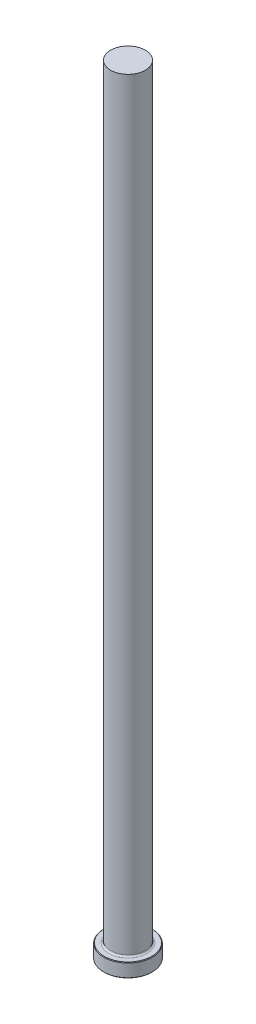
from build123d import *

# Parameters (mm, degrees)
CHAMFER1_SIZE = 0.254
FILLET1_R     = 0.762


with BuildPart() as part:
    # Sketch1 → Revolve1 (revolve)
    with BuildSketch(Plane.XY, mode=Mode.PRIVATE) as revolve1_sk:
        Polygon((0, 0), (-11.1125, 0), (-11.1125, 6.35), (-7.9375, 6.35), (-7.9375, 355.6), (0, 355.6), align=None)
    revolve(revolve1_sk.sketch.rotate(Axis((0, 259.958771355, 0), (0, -1, 0)), 270), axis=Axis((0, 259.958771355, 0), (0, -1, 0)))

    # Chamfer1
    chamfer1_edges = [part.edges().sort_by_distance(p)[0] for p in [
        (0, 6.35, -11.1125),
        (0, 0, -11.1125),
    ]]
    chamfer(chamfer1_edges, length=CHAMFER1_SIZE)

    # Fillet1
    fillet1_edges = [part.edges().sort_by_distance(p)[0] for p in [
        (0, 6.35, -7.9375),
    ]]
    fillet(fillet1_edges, radius=FILLET1_R)


solid = part.part
